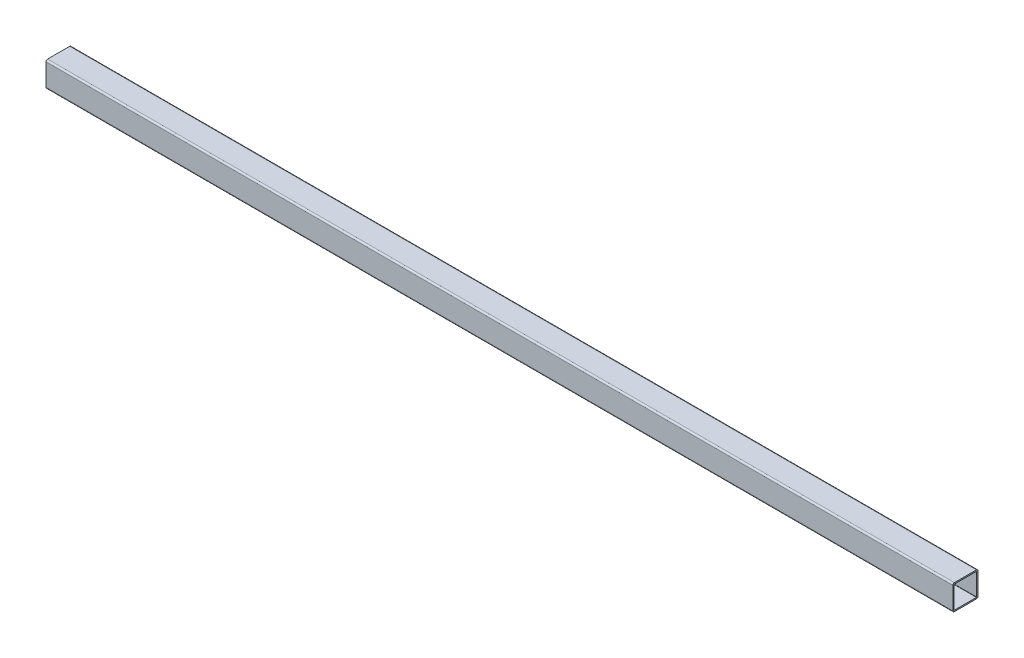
ISO-10303-21;
HEADER;
FILE_DESCRIPTION(('STEP AP214'),'2;1');
FILE_NAME('part.step','',(''),(''),'','','');
FILE_SCHEMA(('AUTOMOTIVE_DESIGN { 1 0 10303 214 1 1 1 1 }'));
ENDSEC;
DATA;
#1=APPLICATION_CONTEXT('core data for automotive mechanical design processes');
#2=APPLICATION_PROTOCOL_DEFINITION('international standard','automotive_design',2000,#1);
#3=PRODUCT_CONTEXT('',#1,'mechanical');
#4=PRODUCT('Part','Part','',(#3));
#5=PRODUCT_RELATED_PRODUCT_CATEGORY('part','',(#4));
#6=PRODUCT_DEFINITION_FORMATION('','',#4);
#7=PRODUCT_DEFINITION_CONTEXT('part definition',#1,'design');
#8=PRODUCT_DEFINITION('design','',#6,#7);
#9=PRODUCT_DEFINITION_SHAPE('','',#8);
#10=(LENGTH_UNIT() NAMED_UNIT(*) SI_UNIT(.MILLI.,.METRE.));
#11=(NAMED_UNIT(*) PLANE_ANGLE_UNIT() SI_UNIT($,.RADIAN.));
#12=(NAMED_UNIT(*) SI_UNIT($,.STERADIAN.) SOLID_ANGLE_UNIT());
#13=UNCERTAINTY_MEASURE_WITH_UNIT(LENGTH_MEASURE(1.E-05),#10,'distance_accuracy_value','');
#14=(GEOMETRIC_REPRESENTATION_CONTEXT(3) GLOBAL_UNCERTAINTY_ASSIGNED_CONTEXT((#13)) GLOBAL_UNIT_ASSIGNED_CONTEXT((#10,
#11,#12)) REPRESENTATION_CONTEXT('',''));
#15=CARTESIAN_POINT('',(0.,0.,0.));
#16=DIRECTION('',(0.,0.,1.));
#17=DIRECTION('',(1.,0.,0.));
#18=AXIS2_PLACEMENT_3D('',#15,#16,#17);
#19=CARTESIAN_POINT('',(914.4,3.65674086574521,-16.8519621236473));
#20=DIRECTION('',(-1.,0.,0.));
#21=DIRECTION('',(0.,0.,1.));
#22=AXIS2_PLACEMENT_3D('',#19,#20,#21);
#23=PLANE('',#22);
#24=CARTESIAN_POINT('',(914.4,3.65674086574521,-16.8519621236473));
#25=DIRECTION('',(1.,0.,0.));
#26=DIRECTION('',(0.,0.,1.));
#27=AXIS2_PLACEMENT_3D('',#24,#25,#26);
#28=CIRCLE('',#27,1.5875);
#29=CARTESIAN_POINT('',(914.4,3.6567408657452,-18.4394621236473));
#30=VERTEX_POINT('',#29);
#31=CARTESIAN_POINT('',(914.4,5.24424086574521,-16.8519621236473));
#32=VERTEX_POINT('',#31);
#33=EDGE_CURVE('E211',#30,#32,#28,.T.);
#34=ORIENTED_EDGE('',*,*,#33,.T.);
#35=DIRECTION('',(0.,0.,1.));
#36=VECTOR('',#35,1.);
#37=CARTESIAN_POINT('',(914.4,5.24424086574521,5.37303787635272));
#38=LINE('',#37,#36);
#39=CARTESIAN_POINT('',(914.4,5.24424086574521,5.37303787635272));
#40=VERTEX_POINT('',#39);
#41=EDGE_CURVE('E214',#32,#40,#38,.T.);
#42=ORIENTED_EDGE('',*,*,#41,.T.);
#43=CARTESIAN_POINT('',(914.4,3.65674086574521,5.37303787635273));
#44=DIRECTION('',(1.,0.,0.));
#45=DIRECTION('',(0.,0.,1.));
#46=AXIS2_PLACEMENT_3D('',#43,#44,#45);
#47=CIRCLE('',#46,1.5875);
#48=CARTESIAN_POINT('',(914.4,3.6567408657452,6.96053787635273));
#49=VERTEX_POINT('',#48);
#50=EDGE_CURVE('E217',#40,#49,#47,.T.);
#51=ORIENTED_EDGE('',*,*,#50,.T.);
#52=DIRECTION('',(0.,-1.,0.));
#53=VECTOR('',#52,1.);
#54=CARTESIAN_POINT('',(914.4,3.6567408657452,6.96053787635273));
#55=LINE('',#54,#53);
#56=CARTESIAN_POINT('',(914.4,-18.5682591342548,6.96053787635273));
#57=VERTEX_POINT('',#56);
#58=EDGE_CURVE('E219',#49,#57,#55,.T.);
#59=ORIENTED_EDGE('',*,*,#58,.T.);
#60=CARTESIAN_POINT('',(914.4,-18.5682591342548,5.37303787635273));
#61=DIRECTION('',(1.,0.,0.));
#62=DIRECTION('',(0.,0.,1.));
#63=AXIS2_PLACEMENT_3D('',#60,#61,#62);
#64=CIRCLE('',#63,1.5875);
#65=CARTESIAN_POINT('',(914.4,-20.1557591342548,5.37303787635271));
#66=VERTEX_POINT('',#65);
#67=EDGE_CURVE('E221',#57,#66,#64,.T.);
#68=ORIENTED_EDGE('',*,*,#67,.T.);
#69=DIRECTION('',(0.,0.,-1.));
#70=VECTOR('',#69,1.);
#71=CARTESIAN_POINT('',(914.4,-20.1557591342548,5.37303787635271));
#72=LINE('',#71,#70);
#73=CARTESIAN_POINT('',(914.4,-20.1557591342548,-16.8519621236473));
#74=VERTEX_POINT('',#73);
#75=EDGE_CURVE('E223',#66,#74,#72,.T.);
#76=ORIENTED_EDGE('',*,*,#75,.T.);
#77=CARTESIAN_POINT('',(914.4,-18.5682591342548,-16.8519621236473));
#78=DIRECTION('',(1.,0.,0.));
#79=DIRECTION('',(0.,0.,1.));
#80=AXIS2_PLACEMENT_3D('',#77,#78,#79);
#81=CIRCLE('',#80,1.5875);
#82=CARTESIAN_POINT('',(914.4,-18.5682591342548,-18.4394621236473));
#83=VERTEX_POINT('',#82);
#84=EDGE_CURVE('E225',#74,#83,#81,.T.);
#85=ORIENTED_EDGE('',*,*,#84,.T.);
#86=DIRECTION('',(0.,1.,0.));
#87=VECTOR('',#86,1.);
#88=CARTESIAN_POINT('',(914.4,3.6567408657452,-18.4394621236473));
#89=LINE('',#88,#87);
#90=EDGE_CURVE('E227',#83,#30,#89,.T.);
#91=ORIENTED_EDGE('',*,*,#90,.T.);
#92=EDGE_LOOP('',(#34,#42,#51,#59,#68,#76,#85,#91));
#93=FACE_BOUND('',#92,.T.);
#94=CARTESIAN_POINT('',(914.4,3.65674086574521,5.37303787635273));
#95=DIRECTION('',(1.,0.,0.));
#96=DIRECTION('',(0.,0.,1.));
#97=AXIS2_PLACEMENT_3D('',#94,#95,#96);
#98=CIRCLE('',#97,0.2413);
#99=CARTESIAN_POINT('',(914.4,3.89804086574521,5.37303787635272));
#100=VERTEX_POINT('',#99);
#101=CARTESIAN_POINT('',(914.4,3.6567408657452,5.61433787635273));
#102=VERTEX_POINT('',#101);
#103=EDGE_CURVE('E146',#100,#102,#98,.T.);
#104=ORIENTED_EDGE('',*,*,#103,.F.);
#105=DIRECTION('',(0.,0.,1.));
#106=VECTOR('',#105,1.);
#107=CARTESIAN_POINT('',(914.4,3.89804086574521,5.37303787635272));
#108=LINE('',#107,#106);
#109=CARTESIAN_POINT('',(914.4,3.89804086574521,-16.8519621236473));
#110=VERTEX_POINT('',#109);
#111=EDGE_CURVE('E179',#110,#100,#108,.T.);
#112=ORIENTED_EDGE('',*,*,#111,.F.);
#113=CARTESIAN_POINT('',(914.4,3.65674086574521,-16.8519621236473));
#114=DIRECTION('',(1.,0.,0.));
#115=DIRECTION('',(0.,0.,1.));
#116=AXIS2_PLACEMENT_3D('',#113,#114,#115);
#117=CIRCLE('',#116,0.2413);
#118=CARTESIAN_POINT('',(914.4,3.65674086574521,-17.0932621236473));
#119=VERTEX_POINT('',#118);
#120=EDGE_CURVE('E177',#119,#110,#117,.T.);
#121=ORIENTED_EDGE('',*,*,#120,.F.);
#122=DIRECTION('',(0.,1.,0.));
#123=VECTOR('',#122,1.);
#124=CARTESIAN_POINT('',(914.4,3.65674086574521,-17.0932621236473));
#125=LINE('',#124,#123);
#126=CARTESIAN_POINT('',(914.4,-18.5682591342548,-17.0932621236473));
#127=VERTEX_POINT('',#126);
#128=EDGE_CURVE('E175',#127,#119,#125,.T.);
#129=ORIENTED_EDGE('',*,*,#128,.F.);
#130=CARTESIAN_POINT('',(914.4,-18.5682591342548,-16.8519621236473));
#131=DIRECTION('',(1.,0.,0.));
#132=DIRECTION('',(0.,0.,1.));
#133=AXIS2_PLACEMENT_3D('',#130,#131,#132);
#134=CIRCLE('',#133,0.241299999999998);
#135=CARTESIAN_POINT('',(914.4,-18.8095591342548,-16.8519621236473));
#136=VERTEX_POINT('',#135);
#137=EDGE_CURVE('E173',#136,#127,#134,.T.);
#138=ORIENTED_EDGE('',*,*,#137,.F.);
#139=DIRECTION('',(0.,0.,-1.));
#140=VECTOR('',#139,1.);
#141=CARTESIAN_POINT('',(914.4,-18.8095591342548,5.37303787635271));
#142=LINE('',#141,#140);
#143=CARTESIAN_POINT('',(914.4,-18.8095591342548,5.37303787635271));
#144=VERTEX_POINT('',#143);
#145=EDGE_CURVE('E169',#144,#136,#142,.T.);
#146=ORIENTED_EDGE('',*,*,#145,.F.);
#147=CARTESIAN_POINT('',(914.4,-18.5682591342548,5.37303787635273));
#148=DIRECTION('',(1.,0.,0.));
#149=DIRECTION('',(0.,0.,1.));
#150=AXIS2_PLACEMENT_3D('',#147,#148,#149);
#151=CIRCLE('',#150,0.241299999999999);
#152=CARTESIAN_POINT('',(914.4,-18.5682591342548,5.61433787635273));
#153=VERTEX_POINT('',#152);
#154=EDGE_CURVE('E167',#153,#144,#151,.T.);
#155=ORIENTED_EDGE('',*,*,#154,.F.);
#156=DIRECTION('',(0.,-1.,0.));
#157=VECTOR('',#156,1.);
#158=CARTESIAN_POINT('',(914.4,3.6567408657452,5.61433787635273));
#159=LINE('',#158,#157);
#160=EDGE_CURVE('E154',#102,#153,#159,.T.);
#161=ORIENTED_EDGE('',*,*,#160,.F.);
#162=EDGE_LOOP('',(#104,#112,#121,#129,#138,#146,#155,#161));
#163=FACE_BOUND('',#162,.T.);
#164=ADVANCED_FACE('F33',(#93,#163),#23,.F.);
#165=CARTESIAN_POINT('',(0.,3.65674086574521,-16.8519621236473));
#166=DIRECTION('',(-1.,0.,0.));
#167=DIRECTION('',(0.,0.,1.));
#168=AXIS2_PLACEMENT_3D('',#165,#166,#167);
#169=PLANE('',#168);
#170=CARTESIAN_POINT('',(0.,3.65674086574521,-16.8519621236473));
#171=DIRECTION('',(1.,0.,0.));
#172=DIRECTION('',(0.,0.,1.));
#173=AXIS2_PLACEMENT_3D('',#170,#171,#172);
#174=CIRCLE('',#173,1.5875);
#175=CARTESIAN_POINT('',(0.,3.6567408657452,-18.4394621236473));
#176=VERTEX_POINT('',#175);
#177=CARTESIAN_POINT('',(0.,5.24424086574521,-16.8519621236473));
#178=VERTEX_POINT('',#177);
#179=EDGE_CURVE('E162',#176,#178,#174,.T.);
#180=ORIENTED_EDGE('',*,*,#179,.F.);
#181=DIRECTION('',(0.,1.,0.));
#182=VECTOR('',#181,1.);
#183=CARTESIAN_POINT('',(0.,3.6567408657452,-18.4394621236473));
#184=LINE('',#183,#182);
#185=CARTESIAN_POINT('',(0.,-18.5682591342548,-18.4394621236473));
#186=VERTEX_POINT('',#185);
#187=EDGE_CURVE('E215',#186,#176,#184,.T.);
#188=ORIENTED_EDGE('',*,*,#187,.F.);
#189=CARTESIAN_POINT('',(0.,-18.5682591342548,-16.8519621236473));
#190=DIRECTION('',(1.,0.,0.));
#191=DIRECTION('',(0.,0.,1.));
#192=AXIS2_PLACEMENT_3D('',#189,#190,#191);
#193=CIRCLE('',#192,1.5875);
#194=CARTESIAN_POINT('',(0.,-20.1557591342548,-16.8519621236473));
#195=VERTEX_POINT('',#194);
#196=EDGE_CURVE('E242',#195,#186,#193,.T.);
#197=ORIENTED_EDGE('',*,*,#196,.F.);
#198=DIRECTION('',(0.,0.,-1.));
#199=VECTOR('',#198,1.);
#200=CARTESIAN_POINT('',(0.,-20.1557591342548,5.37303787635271));
#201=LINE('',#200,#199);
#202=CARTESIAN_POINT('',(0.,-20.1557591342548,5.37303787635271));
#203=VERTEX_POINT('',#202);
#204=EDGE_CURVE('E240',#203,#195,#201,.T.);
#205=ORIENTED_EDGE('',*,*,#204,.F.);
#206=CARTESIAN_POINT('',(0.,-18.5682591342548,5.37303787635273));
#207=DIRECTION('',(1.,0.,0.));
#208=DIRECTION('',(0.,0.,1.));
#209=AXIS2_PLACEMENT_3D('',#206,#207,#208);
#210=CIRCLE('',#209,1.5875);
#211=CARTESIAN_POINT('',(0.,-18.5682591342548,6.96053787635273));
#212=VERTEX_POINT('',#211);
#213=EDGE_CURVE('E238',#212,#203,#210,.T.);
#214=ORIENTED_EDGE('',*,*,#213,.F.);
#215=DIRECTION('',(0.,-1.,0.));
#216=VECTOR('',#215,1.);
#217=CARTESIAN_POINT('',(0.,3.6567408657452,6.96053787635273));
#218=LINE('',#217,#216);
#219=CARTESIAN_POINT('',(0.,3.6567408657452,6.96053787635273));
#220=VERTEX_POINT('',#219);
#221=EDGE_CURVE('E236',#220,#212,#218,.T.);
#222=ORIENTED_EDGE('',*,*,#221,.F.);
#223=CARTESIAN_POINT('',(0.,3.65674086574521,5.37303787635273));
#224=DIRECTION('',(1.,0.,0.));
#225=DIRECTION('',(0.,0.,1.));
#226=AXIS2_PLACEMENT_3D('',#223,#224,#225);
#227=CIRCLE('',#226,1.5875);
#228=CARTESIAN_POINT('',(0.,5.24424086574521,5.37303787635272));
#229=VERTEX_POINT('',#228);
#230=EDGE_CURVE('E234',#229,#220,#227,.T.);
#231=ORIENTED_EDGE('',*,*,#230,.F.);
#232=DIRECTION('',(0.,0.,1.));
#233=VECTOR('',#232,1.);
#234=CARTESIAN_POINT('',(0.,5.24424086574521,5.37303787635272));
#235=LINE('',#234,#233);
#236=EDGE_CURVE('E232',#178,#229,#235,.T.);
#237=ORIENTED_EDGE('',*,*,#236,.F.);
#238=EDGE_LOOP('',(#180,#188,#197,#205,#214,#222,#231,#237));
#239=FACE_BOUND('',#238,.T.);
#240=DIRECTION('',(0.,0.,1.));
#241=VECTOR('',#240,1.);
#242=CARTESIAN_POINT('',(0.,3.89804086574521,5.37303787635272));
#243=LINE('',#242,#241);
#244=CARTESIAN_POINT('',(0.,3.89804086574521,-16.8519621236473));
#245=VERTEX_POINT('',#244);
#246=CARTESIAN_POINT('',(0.,3.89804086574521,5.37303787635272));
#247=VERTEX_POINT('',#246);
#248=EDGE_CURVE('E155',#245,#247,#243,.T.);
#249=ORIENTED_EDGE('',*,*,#248,.T.);
#250=CARTESIAN_POINT('',(0.,3.65674086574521,5.37303787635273));
#251=DIRECTION('',(1.,0.,0.));
#252=DIRECTION('',(0.,0.,1.));
#253=AXIS2_PLACEMENT_3D('',#250,#251,#252);
#254=CIRCLE('',#253,0.2413);
#255=CARTESIAN_POINT('',(0.,3.6567408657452,5.61433787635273));
#256=VERTEX_POINT('',#255);
#257=EDGE_CURVE('E56',#247,#256,#254,.T.);
#258=ORIENTED_EDGE('',*,*,#257,.T.);
#259=DIRECTION('',(0.,-1.,0.));
#260=VECTOR('',#259,1.);
#261=CARTESIAN_POINT('',(0.,3.6567408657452,5.61433787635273));
#262=LINE('',#261,#260);
#263=CARTESIAN_POINT('',(0.,-18.5682591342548,5.61433787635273));
#264=VERTEX_POINT('',#263);
#265=EDGE_CURVE('E161',#256,#264,#262,.T.);
#266=ORIENTED_EDGE('',*,*,#265,.T.);
#267=CARTESIAN_POINT('',(0.,-18.5682591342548,5.37303787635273));
#268=DIRECTION('',(1.,0.,0.));
#269=DIRECTION('',(0.,0.,1.));
#270=AXIS2_PLACEMENT_3D('',#267,#268,#269);
#271=CIRCLE('',#270,0.241299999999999);
#272=CARTESIAN_POINT('',(0.,-18.8095591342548,5.37303787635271));
#273=VERTEX_POINT('',#272);
#274=EDGE_CURVE('E183',#264,#273,#271,.T.);
#275=ORIENTED_EDGE('',*,*,#274,.T.);
#276=DIRECTION('',(0.,0.,-1.));
#277=VECTOR('',#276,1.);
#278=CARTESIAN_POINT('',(0.,-18.8095591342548,5.37303787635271));
#279=LINE('',#278,#277);
#280=CARTESIAN_POINT('',(0.,-18.8095591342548,-16.8519621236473));
#281=VERTEX_POINT('',#280);
#282=EDGE_CURVE('E186',#273,#281,#279,.T.);
#283=ORIENTED_EDGE('',*,*,#282,.T.);
#284=CARTESIAN_POINT('',(0.,-18.5682591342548,-16.8519621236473));
#285=DIRECTION('',(1.,0.,0.));
#286=DIRECTION('',(0.,0.,1.));
#287=AXIS2_PLACEMENT_3D('',#284,#285,#286);
#288=CIRCLE('',#287,0.241299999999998);
#289=CARTESIAN_POINT('',(0.,-18.5682591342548,-17.0932621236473));
#290=VERTEX_POINT('',#289);
#291=EDGE_CURVE('E189',#281,#290,#288,.T.);
#292=ORIENTED_EDGE('',*,*,#291,.T.);
#293=DIRECTION('',(0.,1.,0.));
#294=VECTOR('',#293,1.);
#295=CARTESIAN_POINT('',(0.,3.65674086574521,-17.0932621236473));
#296=LINE('',#295,#294);
#297=CARTESIAN_POINT('',(0.,3.65674086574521,-17.0932621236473));
#298=VERTEX_POINT('',#297);
#299=EDGE_CURVE('E192',#290,#298,#296,.T.);
#300=ORIENTED_EDGE('',*,*,#299,.T.);
#301=CARTESIAN_POINT('',(0.,3.65674086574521,-16.8519621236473));
#302=DIRECTION('',(1.,0.,0.));
#303=DIRECTION('',(0.,0.,1.));
#304=AXIS2_PLACEMENT_3D('',#301,#302,#303);
#305=CIRCLE('',#304,0.2413);
#306=EDGE_CURVE('E195',#298,#245,#305,.T.);
#307=ORIENTED_EDGE('',*,*,#306,.T.);
#308=EDGE_LOOP('',(#249,#258,#266,#275,#283,#292,#300,#307));
#309=FACE_BOUND('',#308,.T.);
#310=ADVANCED_FACE('F272',(#239,#309),#169,.T.);
#311=CARTESIAN_POINT('',(914.4,3.65674086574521,-16.8519621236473));
#312=DIRECTION('',(-1.,0.,0.));
#313=DIRECTION('',(0.,0.,1.));
#314=AXIS2_PLACEMENT_3D('',#311,#312,#313);
#315=CYLINDRICAL_SURFACE('',#314,1.5875);
#316=ORIENTED_EDGE('',*,*,#179,.T.);
#317=DIRECTION('',(-1.,0.,0.));
#318=VECTOR('',#317,1.);
#319=CARTESIAN_POINT('',(914.4,5.24424086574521,-16.8519621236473));
#320=LINE('',#319,#318);
#321=EDGE_CURVE('E11',#32,#178,#320,.T.);
#322=ORIENTED_EDGE('',*,*,#321,.F.);
#323=ORIENTED_EDGE('',*,*,#33,.F.);
#324=DIRECTION('',(-1.,0.,0.));
#325=VECTOR('',#324,1.);
#326=CARTESIAN_POINT('',(914.4,3.6567408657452,-18.4394621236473));
#327=LINE('',#326,#325);
#328=EDGE_CURVE('E229',#30,#176,#327,.T.);
#329=ORIENTED_EDGE('',*,*,#328,.T.);
#330=EDGE_LOOP('',(#316,#322,#323,#329));
#331=FACE_BOUND('',#330,.T.);
#332=ADVANCED_FACE('F35',(#331),#315,.T.);
#333=CARTESIAN_POINT('',(914.4,5.24424086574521,5.37303787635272));
#334=DIRECTION('',(0.,-1.,0.));
#335=DIRECTION('',(0.,0.,-1.));
#336=AXIS2_PLACEMENT_3D('',#333,#334,#335);
#337=PLANE('',#336);
#338=ORIENTED_EDGE('',*,*,#236,.T.);
#339=DIRECTION('',(-1.,0.,0.));
#340=VECTOR('',#339,1.);
#341=CARTESIAN_POINT('',(914.4,5.24424086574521,5.37303787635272));
#342=LINE('',#341,#340);
#343=EDGE_CURVE('E41',#40,#229,#342,.T.);
#344=ORIENTED_EDGE('',*,*,#343,.F.);
#345=ORIENTED_EDGE('',*,*,#41,.F.);
#346=ORIENTED_EDGE('',*,*,#321,.T.);
#347=EDGE_LOOP('',(#338,#344,#345,#346));
#348=FACE_BOUND('',#347,.T.);
#349=ADVANCED_FACE('F289',(#348),#337,.F.);
#350=CARTESIAN_POINT('',(914.4,3.65674086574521,5.37303787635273));
#351=DIRECTION('',(-1.,0.,0.));
#352=DIRECTION('',(0.,0.,1.));
#353=AXIS2_PLACEMENT_3D('',#350,#351,#352);
#354=CYLINDRICAL_SURFACE('',#353,1.5875);
#355=ORIENTED_EDGE('',*,*,#230,.T.);
#356=DIRECTION('',(-1.,0.,0.));
#357=VECTOR('',#356,1.);
#358=CARTESIAN_POINT('',(914.4,3.6567408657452,6.96053787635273));
#359=LINE('',#358,#357);
#360=EDGE_CURVE('E259',#49,#220,#359,.T.);
#361=ORIENTED_EDGE('',*,*,#360,.F.);
#362=ORIENTED_EDGE('',*,*,#50,.F.);
#363=ORIENTED_EDGE('',*,*,#343,.T.);
#364=EDGE_LOOP('',(#355,#361,#362,#363));
#365=FACE_BOUND('',#364,.T.);
#366=ADVANCED_FACE('F266',(#365),#354,.T.);
#367=CARTESIAN_POINT('',(914.4,3.6567408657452,6.96053787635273));
#368=DIRECTION('',(0.,0.,-1.));
#369=DIRECTION('',(0.,1.,0.));
#370=AXIS2_PLACEMENT_3D('',#367,#368,#369);
#371=PLANE('',#370);
#372=ORIENTED_EDGE('',*,*,#221,.T.);
#373=DIRECTION('',(-1.,0.,0.));
#374=VECTOR('',#373,1.);
#375=CARTESIAN_POINT('',(914.4,-18.5682591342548,6.96053787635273));
#376=LINE('',#375,#374);
#377=EDGE_CURVE('E256',#57,#212,#376,.T.);
#378=ORIENTED_EDGE('',*,*,#377,.F.);
#379=ORIENTED_EDGE('',*,*,#58,.F.);
#380=ORIENTED_EDGE('',*,*,#360,.T.);
#381=EDGE_LOOP('',(#372,#378,#379,#380));
#382=FACE_BOUND('',#381,.T.);
#383=ADVANCED_FACE('F278',(#382),#371,.F.);
#384=CARTESIAN_POINT('',(914.4,-18.5682591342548,5.37303787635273));
#385=DIRECTION('',(-1.,0.,0.));
#386=DIRECTION('',(0.,0.,1.));
#387=AXIS2_PLACEMENT_3D('',#384,#385,#386);
#388=CYLINDRICAL_SURFACE('',#387,1.5875);
#389=ORIENTED_EDGE('',*,*,#213,.T.);
#390=DIRECTION('',(-1.,0.,0.));
#391=VECTOR('',#390,1.);
#392=CARTESIAN_POINT('',(914.4,-20.1557591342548,5.37303787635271));
#393=LINE('',#392,#391);
#394=EDGE_CURVE('E253',#66,#203,#393,.T.);
#395=ORIENTED_EDGE('',*,*,#394,.F.);
#396=ORIENTED_EDGE('',*,*,#67,.F.);
#397=ORIENTED_EDGE('',*,*,#377,.T.);
#398=EDGE_LOOP('',(#389,#395,#396,#397));
#399=FACE_BOUND('',#398,.T.);
#400=ADVANCED_FACE('F282',(#399),#388,.T.);
#401=CARTESIAN_POINT('',(914.4,-20.1557591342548,5.37303787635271));
#402=DIRECTION('',(0.,1.,0.));
#403=DIRECTION('',(0.,0.,1.));
#404=AXIS2_PLACEMENT_3D('',#401,#402,#403);
#405=PLANE('',#404);
#406=ORIENTED_EDGE('',*,*,#204,.T.);
#407=DIRECTION('',(-1.,0.,0.));
#408=VECTOR('',#407,1.);
#409=CARTESIAN_POINT('',(914.4,-20.1557591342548,-16.8519621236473));
#410=LINE('',#409,#408);
#411=EDGE_CURVE('E250',#74,#195,#410,.T.);
#412=ORIENTED_EDGE('',*,*,#411,.F.);
#413=ORIENTED_EDGE('',*,*,#75,.F.);
#414=ORIENTED_EDGE('',*,*,#394,.T.);
#415=EDGE_LOOP('',(#406,#412,#413,#414));
#416=FACE_BOUND('',#415,.T.);
#417=ADVANCED_FACE('F302',(#416),#405,.F.);
#418=CARTESIAN_POINT('',(914.4,-18.5682591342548,-16.8519621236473));
#419=DIRECTION('',(-1.,0.,0.));
#420=DIRECTION('',(0.,0.,1.));
#421=AXIS2_PLACEMENT_3D('',#418,#419,#420);
#422=CYLINDRICAL_SURFACE('',#421,1.5875);
#423=ORIENTED_EDGE('',*,*,#196,.T.);
#424=DIRECTION('',(-1.,0.,0.));
#425=VECTOR('',#424,1.);
#426=CARTESIAN_POINT('',(914.4,-18.5682591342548,-18.4394621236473));
#427=LINE('',#426,#425);
#428=EDGE_CURVE('E247',#83,#186,#427,.T.);
#429=ORIENTED_EDGE('',*,*,#428,.F.);
#430=ORIENTED_EDGE('',*,*,#84,.F.);
#431=ORIENTED_EDGE('',*,*,#411,.T.);
#432=EDGE_LOOP('',(#423,#429,#430,#431));
#433=FACE_BOUND('',#432,.T.);
#434=ADVANCED_FACE('F300',(#433),#422,.T.);
#435=CARTESIAN_POINT('',(914.4,3.6567408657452,-18.4394621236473));
#436=DIRECTION('',(0.,0.,1.));
#437=DIRECTION('',(0.,-1.,0.));
#438=AXIS2_PLACEMENT_3D('',#435,#436,#437);
#439=PLANE('',#438);
#440=ORIENTED_EDGE('',*,*,#187,.T.);
#441=ORIENTED_EDGE('',*,*,#328,.F.);
#442=ORIENTED_EDGE('',*,*,#90,.F.);
#443=ORIENTED_EDGE('',*,*,#428,.T.);
#444=EDGE_LOOP('',(#440,#441,#442,#443));
#445=FACE_BOUND('',#444,.T.);
#446=ADVANCED_FACE('F295',(#445),#439,.F.);
#447=CARTESIAN_POINT('',(914.4,3.65674086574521,5.37303787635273));
#448=DIRECTION('',(-1.,0.,0.));
#449=DIRECTION('',(0.,0.,1.));
#450=AXIS2_PLACEMENT_3D('',#447,#448,#449);
#451=CYLINDRICAL_SURFACE('',#450,0.2413);
#452=ORIENTED_EDGE('',*,*,#257,.F.);
#453=DIRECTION('',(-1.,0.,0.));
#454=VECTOR('',#453,1.);
#455=CARTESIAN_POINT('',(914.4,3.89804086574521,5.37303787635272));
#456=LINE('',#455,#454);
#457=EDGE_CURVE('E150',#100,#247,#456,.T.);
#458=ORIENTED_EDGE('',*,*,#457,.F.);
#459=ORIENTED_EDGE('',*,*,#103,.T.);
#460=DIRECTION('',(-1.,0.,0.));
#461=VECTOR('',#460,1.);
#462=CARTESIAN_POINT('',(914.4,3.6567408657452,5.61433787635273));
#463=LINE('',#462,#461);
#464=EDGE_CURVE('E149',#102,#256,#463,.T.);
#465=ORIENTED_EDGE('',*,*,#464,.T.);
#466=EDGE_LOOP('',(#452,#458,#459,#465));
#467=FACE_BOUND('',#466,.T.);
#468=ADVANCED_FACE('F148',(#467),#451,.F.);
#469=CARTESIAN_POINT('',(914.4,3.6567408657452,5.61433787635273));
#470=DIRECTION('',(0.,0.,-1.));
#471=DIRECTION('',(0.,1.,0.));
#472=AXIS2_PLACEMENT_3D('',#469,#470,#471);
#473=PLANE('',#472);
#474=ORIENTED_EDGE('',*,*,#265,.F.);
#475=ORIENTED_EDGE('',*,*,#464,.F.);
#476=ORIENTED_EDGE('',*,*,#160,.T.);
#477=DIRECTION('',(-1.,0.,0.));
#478=VECTOR('',#477,1.);
#479=CARTESIAN_POINT('',(914.4,-18.5682591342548,5.61433787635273));
#480=LINE('',#479,#478);
#481=EDGE_CURVE('E163',#153,#264,#480,.T.);
#482=ORIENTED_EDGE('',*,*,#481,.T.);
#483=EDGE_LOOP('',(#474,#475,#476,#482));
#484=FACE_BOUND('',#483,.T.);
#485=ADVANCED_FACE('F158',(#484),#473,.T.);
#486=CARTESIAN_POINT('',(914.4,-18.5682591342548,5.37303787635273));
#487=DIRECTION('',(-1.,0.,0.));
#488=DIRECTION('',(0.,0.,1.));
#489=AXIS2_PLACEMENT_3D('',#486,#487,#488);
#490=CYLINDRICAL_SURFACE('',#489,0.241299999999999);
#491=ORIENTED_EDGE('',*,*,#274,.F.);
#492=ORIENTED_EDGE('',*,*,#481,.F.);
#493=ORIENTED_EDGE('',*,*,#154,.T.);
#494=DIRECTION('',(-1.,0.,0.));
#495=VECTOR('',#494,1.);
#496=CARTESIAN_POINT('',(914.4,-18.8095591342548,5.37303787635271));
#497=LINE('',#496,#495);
#498=EDGE_CURVE('E208',#144,#273,#497,.T.);
#499=ORIENTED_EDGE('',*,*,#498,.T.);
#500=EDGE_LOOP('',(#491,#492,#493,#499));
#501=FACE_BOUND('',#500,.T.);
#502=ADVANCED_FACE('F327',(#501),#490,.F.);
#503=CARTESIAN_POINT('',(914.4,-18.8095591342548,5.37303787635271));
#504=DIRECTION('',(0.,1.,0.));
#505=DIRECTION('',(0.,0.,1.));
#506=AXIS2_PLACEMENT_3D('',#503,#504,#505);
#507=PLANE('',#506);
#508=ORIENTED_EDGE('',*,*,#282,.F.);
#509=ORIENTED_EDGE('',*,*,#498,.F.);
#510=ORIENTED_EDGE('',*,*,#145,.T.);
#511=DIRECTION('',(-1.,0.,0.));
#512=VECTOR('',#511,1.);
#513=CARTESIAN_POINT('',(914.4,-18.8095591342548,-16.8519621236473));
#514=LINE('',#513,#512);
#515=EDGE_CURVE('E206',#136,#281,#514,.T.);
#516=ORIENTED_EDGE('',*,*,#515,.T.);
#517=EDGE_LOOP('',(#508,#509,#510,#516));
#518=FACE_BOUND('',#517,.T.);
#519=ADVANCED_FACE('F331',(#518),#507,.T.);
#520=CARTESIAN_POINT('',(914.4,-18.5682591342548,-16.8519621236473));
#521=DIRECTION('',(-1.,0.,0.));
#522=DIRECTION('',(0.,0.,1.));
#523=AXIS2_PLACEMENT_3D('',#520,#521,#522);
#524=CYLINDRICAL_SURFACE('',#523,0.241299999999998);
#525=ORIENTED_EDGE('',*,*,#291,.F.);
#526=ORIENTED_EDGE('',*,*,#515,.F.);
#527=ORIENTED_EDGE('',*,*,#137,.T.);
#528=DIRECTION('',(-1.,0.,0.));
#529=VECTOR('',#528,1.);
#530=CARTESIAN_POINT('',(914.4,-18.5682591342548,-17.0932621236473));
#531=LINE('',#530,#529);
#532=EDGE_CURVE('E204',#127,#290,#531,.T.);
#533=ORIENTED_EDGE('',*,*,#532,.T.);
#534=EDGE_LOOP('',(#525,#526,#527,#533));
#535=FACE_BOUND('',#534,.T.);
#536=ADVANCED_FACE('F337',(#535),#524,.F.);
#537=CARTESIAN_POINT('',(914.4,3.65674086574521,-17.0932621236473));
#538=DIRECTION('',(0.,0.,1.));
#539=DIRECTION('',(1.,0.,0.));
#540=AXIS2_PLACEMENT_3D('',#537,#538,#539);
#541=PLANE('',#540);
#542=ORIENTED_EDGE('',*,*,#299,.F.);
#543=ORIENTED_EDGE('',*,*,#532,.F.);
#544=ORIENTED_EDGE('',*,*,#128,.T.);
#545=DIRECTION('',(-1.,0.,0.));
#546=VECTOR('',#545,1.);
#547=CARTESIAN_POINT('',(914.4,3.65674086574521,-17.0932621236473));
#548=LINE('',#547,#546);
#549=EDGE_CURVE('E202',#119,#298,#548,.T.);
#550=ORIENTED_EDGE('',*,*,#549,.T.);
#551=EDGE_LOOP('',(#542,#543,#544,#550));
#552=FACE_BOUND('',#551,.T.);
#553=ADVANCED_FACE('F341',(#552),#541,.T.);
#554=CARTESIAN_POINT('',(914.4,3.65674086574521,-16.8519621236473));
#555=DIRECTION('',(-1.,0.,0.));
#556=DIRECTION('',(0.,0.,1.));
#557=AXIS2_PLACEMENT_3D('',#554,#555,#556);
#558=CYLINDRICAL_SURFACE('',#557,0.2413);
#559=ORIENTED_EDGE('',*,*,#306,.F.);
#560=ORIENTED_EDGE('',*,*,#549,.F.);
#561=ORIENTED_EDGE('',*,*,#120,.T.);
#562=DIRECTION('',(-1.,0.,0.));
#563=VECTOR('',#562,1.);
#564=CARTESIAN_POINT('',(914.4,3.89804086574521,-16.8519621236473));
#565=LINE('',#564,#563);
#566=EDGE_CURVE('E48',#110,#245,#565,.T.);
#567=ORIENTED_EDGE('',*,*,#566,.T.);
#568=EDGE_LOOP('',(#559,#560,#561,#567));
#569=FACE_BOUND('',#568,.T.);
#570=ADVANCED_FACE('F345',(#569),#558,.F.);
#571=CARTESIAN_POINT('',(914.4,3.89804086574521,5.37303787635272));
#572=DIRECTION('',(0.,-1.,0.));
#573=DIRECTION('',(0.,0.,-1.));
#574=AXIS2_PLACEMENT_3D('',#571,#572,#573);
#575=PLANE('',#574);
#576=ORIENTED_EDGE('',*,*,#248,.F.);
#577=ORIENTED_EDGE('',*,*,#566,.F.);
#578=ORIENTED_EDGE('',*,*,#111,.T.);
#579=ORIENTED_EDGE('',*,*,#457,.T.);
#580=EDGE_LOOP('',(#576,#577,#578,#579));
#581=FACE_BOUND('',#580,.T.);
#582=ADVANCED_FACE('F349',(#581),#575,.T.);
#583=CLOSED_SHELL('',(#164,#310,#332,#349,#366,#383,#400,#417,#434,#446,#468,#485,#502,#519,
#536,#553,#570,#582));
#584=MANIFOLD_SOLID_BREP('B2',#583);
#585=ADVANCED_BREP_SHAPE_REPRESENTATION('',(#18,#584),#14);
#586=SHAPE_DEFINITION_REPRESENTATION(#9,#585);
ENDSEC;
END-ISO-10303-21;
